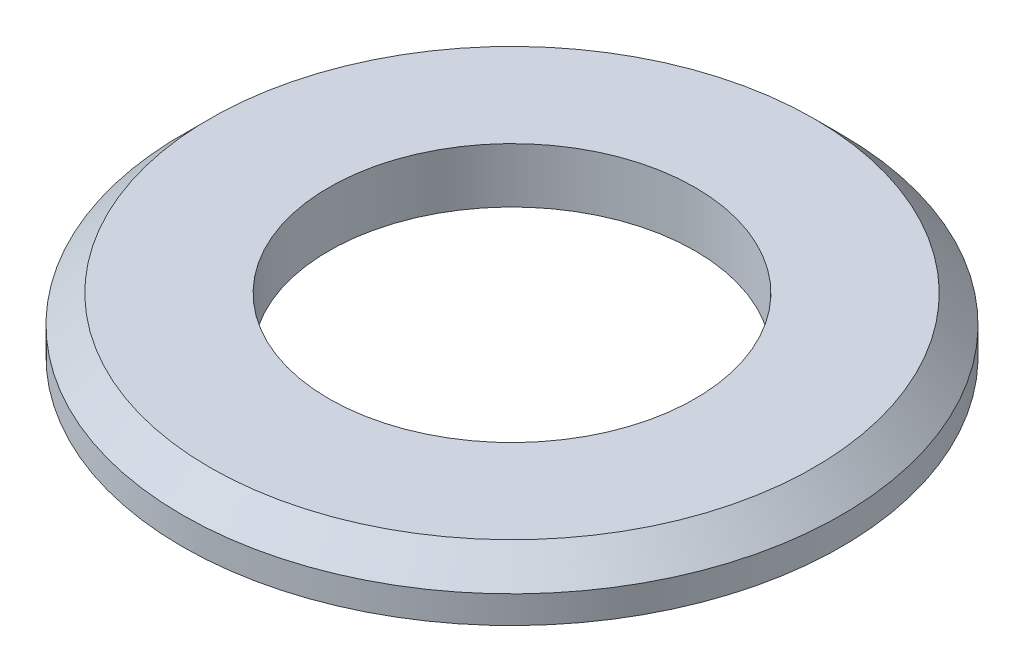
ISO-10303-21;
HEADER;
FILE_DESCRIPTION(('STEP AP214'),'2;1');
FILE_NAME('part.step','',(''),(''),'','','');
FILE_SCHEMA(('AUTOMOTIVE_DESIGN { 1 0 10303 214 1 1 1 1 }'));
ENDSEC;
DATA;
#1=APPLICATION_CONTEXT('core data for automotive mechanical design processes');
#2=APPLICATION_PROTOCOL_DEFINITION('international standard','automotive_design',2000,#1);
#3=PRODUCT_CONTEXT('',#1,'mechanical');
#4=PRODUCT('Part','Part','',(#3));
#5=PRODUCT_RELATED_PRODUCT_CATEGORY('part','',(#4));
#6=PRODUCT_DEFINITION_FORMATION('','',#4);
#7=PRODUCT_DEFINITION_CONTEXT('part definition',#1,'design');
#8=PRODUCT_DEFINITION('design','',#6,#7);
#9=PRODUCT_DEFINITION_SHAPE('','',#8);
#10=(LENGTH_UNIT() NAMED_UNIT(*) SI_UNIT(.MILLI.,.METRE.));
#11=(NAMED_UNIT(*) PLANE_ANGLE_UNIT() SI_UNIT($,.RADIAN.));
#12=(NAMED_UNIT(*) SI_UNIT($,.STERADIAN.) SOLID_ANGLE_UNIT());
#13=UNCERTAINTY_MEASURE_WITH_UNIT(LENGTH_MEASURE(1.E-05),#10,'distance_accuracy_value','');
#14=(GEOMETRIC_REPRESENTATION_CONTEXT(3) GLOBAL_UNCERTAINTY_ASSIGNED_CONTEXT((#13)) GLOBAL_UNIT_ASSIGNED_CONTEXT((#10,
#11,#12)) REPRESENTATION_CONTEXT('',''));
#15=CARTESIAN_POINT('',(0.,0.,0.));
#16=DIRECTION('',(0.,0.,1.));
#17=DIRECTION('',(1.,0.,0.));
#18=AXIS2_PLACEMENT_3D('',#15,#16,#17);
#19=CARTESIAN_POINT('',(0.,6.,0.));
#20=DIRECTION('',(0.,1.,0.));
#21=DIRECTION('',(0.,0.,1.));
#22=AXIS2_PLACEMENT_3D('',#19,#20,#21);
#23=PLANE('',#22);
#24=CARTESIAN_POINT('',(0.,6.,0.));
#25=DIRECTION('',(0.,1.,0.));
#26=DIRECTION('',(0.,0.,1.));
#27=AXIS2_PLACEMENT_3D('',#24,#25,#26);
#28=CIRCLE('',#27,33.);
#29=CARTESIAN_POINT('',(0.,6.,33.));
#30=VERTEX_POINT('',#29);
#31=EDGE_CURVE('E35',#30,#30,#28,.T.);
#32=ORIENTED_EDGE('',*,*,#31,.T.);
#33=EDGE_LOOP('',(#32));
#34=FACE_BOUND('',#33,.T.);
#35=CARTESIAN_POINT('',(0.,6.,0.));
#36=DIRECTION('',(0.,1.,0.));
#37=DIRECTION('',(0.,0.,1.));
#38=AXIS2_PLACEMENT_3D('',#35,#36,#37);
#39=CIRCLE('',#38,20.);
#40=CARTESIAN_POINT('',(0.,6.,20.));
#41=VERTEX_POINT('',#40);
#42=EDGE_CURVE('E43',#41,#41,#39,.T.);
#43=ORIENTED_EDGE('',*,*,#42,.F.);
#44=EDGE_LOOP('',(#43));
#45=FACE_BOUND('',#44,.T.);
#46=ADVANCED_FACE('F28',(#34,#45),#23,.T.);
#47=CARTESIAN_POINT('',(0.,0.,0.));
#48=DIRECTION('',(0.,1.,0.));
#49=DIRECTION('',(0.,0.,1.));
#50=AXIS2_PLACEMENT_3D('',#47,#48,#49);
#51=PLANE('',#50);
#52=CARTESIAN_POINT('',(0.,0.,0.));
#53=DIRECTION('',(0.,1.,0.));
#54=DIRECTION('',(0.,0.,1.));
#55=AXIS2_PLACEMENT_3D('',#52,#53,#54);
#56=CIRCLE('',#55,36.);
#57=CARTESIAN_POINT('',(0.,0.,36.));
#58=VERTEX_POINT('',#57);
#59=EDGE_CURVE('E39',#58,#58,#56,.T.);
#60=ORIENTED_EDGE('',*,*,#59,.F.);
#61=EDGE_LOOP('',(#60));
#62=FACE_BOUND('',#61,.T.);
#63=CARTESIAN_POINT('',(0.,0.,0.));
#64=DIRECTION('',(0.,1.,0.));
#65=DIRECTION('',(0.,0.,1.));
#66=AXIS2_PLACEMENT_3D('',#63,#64,#65);
#67=CIRCLE('',#66,20.);
#68=CARTESIAN_POINT('',(0.,0.,20.));
#69=VERTEX_POINT('',#68);
#70=EDGE_CURVE('E48',#69,#69,#67,.T.);
#71=ORIENTED_EDGE('',*,*,#70,.T.);
#72=EDGE_LOOP('',(#71));
#73=FACE_BOUND('',#72,.T.);
#74=ADVANCED_FACE('F52',(#62,#73),#51,.F.);
#75=CARTESIAN_POINT('',(0.,6.,0.));
#76=DIRECTION('',(0.,-1.,0.));
#77=DIRECTION('',(0.,0.,-1.));
#78=AXIS2_PLACEMENT_3D('',#75,#76,#77);
#79=CYLINDRICAL_SURFACE('',#78,36.);
#80=CARTESIAN_POINT('',(0.,2.99999999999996,0.));
#81=DIRECTION('',(0.,1.,0.));
#82=DIRECTION('',(0.,0.,1.));
#83=AXIS2_PLACEMENT_3D('',#80,#81,#82);
#84=CIRCLE('',#83,36.);
#85=CARTESIAN_POINT('',(0.,2.99999999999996,36.));
#86=VERTEX_POINT('',#85);
#87=EDGE_CURVE('E10',#86,#86,#84,.F.);
#88=ORIENTED_EDGE('',*,*,#87,.T.);
#89=EDGE_LOOP('',(#88));
#90=FACE_BOUND('',#89,.T.);
#91=ORIENTED_EDGE('',*,*,#59,.T.);
#92=EDGE_LOOP('',(#91));
#93=FACE_BOUND('',#92,.T.);
#94=ADVANCED_FACE('F30',(#90,#93),#79,.T.);
#95=CARTESIAN_POINT('',(0.,6.,0.));
#96=DIRECTION('',(0.,-1.,0.));
#97=DIRECTION('',(0.,0.,-1.));
#98=AXIS2_PLACEMENT_3D('',#95,#96,#97);
#99=CYLINDRICAL_SURFACE('',#98,20.);
#100=ORIENTED_EDGE('',*,*,#42,.T.);
#101=EDGE_LOOP('',(#100));
#102=FACE_BOUND('',#101,.T.);
#103=ORIENTED_EDGE('',*,*,#70,.F.);
#104=EDGE_LOOP('',(#103));
#105=FACE_BOUND('',#104,.T.);
#106=ADVANCED_FACE('F54',(#102,#105),#99,.F.);
#107=CARTESIAN_POINT('',(0.,6.,0.));
#108=DIRECTION('',(0.,-1.,0.));
#109=DIRECTION('',(0.,0.,-1.));
#110=AXIS2_PLACEMENT_3D('',#107,#108,#109);
#111=CONICAL_SURFACE('',#110,33.,0.785398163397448);
#112=ORIENTED_EDGE('',*,*,#87,.F.);
#113=EDGE_LOOP('',(#112));
#114=FACE_BOUND('',#113,.T.);
#115=ORIENTED_EDGE('',*,*,#31,.F.);
#116=EDGE_LOOP('',(#115));
#117=FACE_BOUND('',#116,.T.);
#118=ADVANCED_FACE('F56',(#114,#117),#111,.T.);
#119=CLOSED_SHELL('',(#46,#74,#94,#106,#118));
#120=MANIFOLD_SOLID_BREP('B2',#119);
#121=ADVANCED_BREP_SHAPE_REPRESENTATION('',(#18,#120),#14);
#122=SHAPE_DEFINITION_REPRESENTATION(#9,#121);
ENDSEC;
END-ISO-10303-21;
